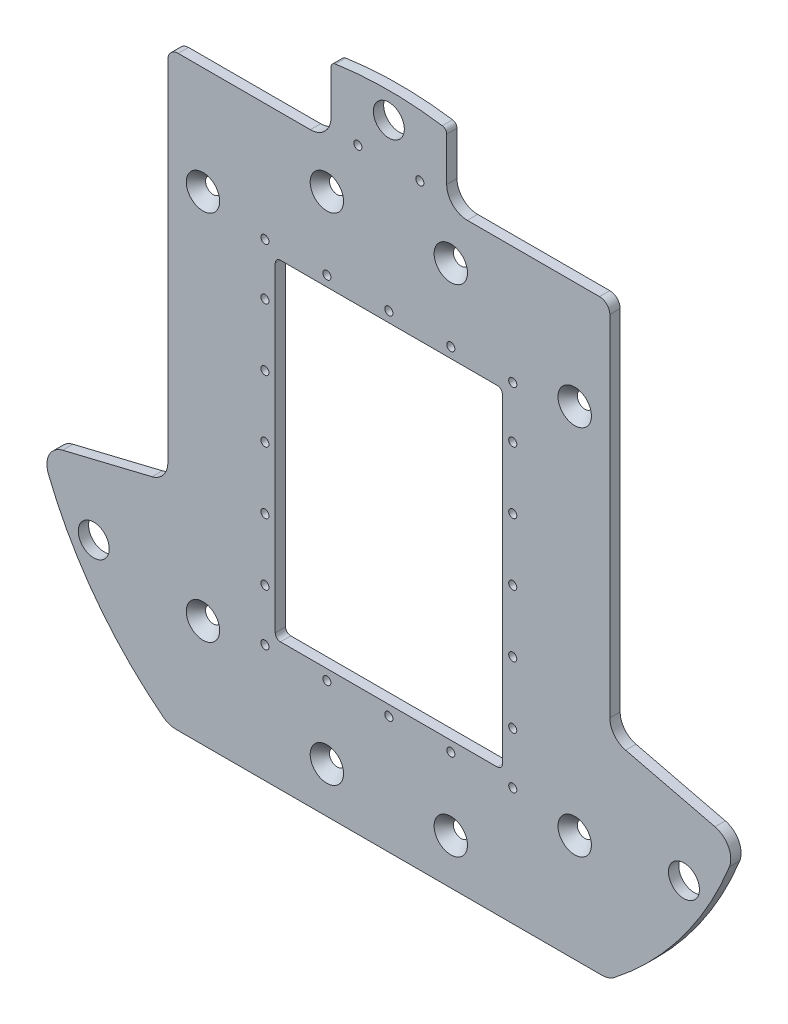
from build123d import *

# Parameters (mm, degrees)
SKETCH1_R                                      = 225.425
BOSS_EXTRUDE1_DEPTH                            = 3.175
F_3_4_0_75_DIAMETER_HOLE1_D                    = 19.05
CUT_EXTRUDE3_DEPTH                             = 319.814902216
CUT_EXTRUDE3_DEPTH_BACK                        = 319.814902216
SKETCH9_W                                      = 677.934066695
SKETCH9_H                                      = 88.131619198
SKETCH3_W                                      = 139.7
SKETCH3_H                                      = 203.2
CUT_EXTRUDE2_DEPTH                             = 312.117600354
CSK_FOR_5_16_FLAT_HEAD_MACHINE_SCREW1_AT_COUNT = 2
CSK_FOR_5_16_FLAT_HEAD_MACHINE_SCREW1_AT_PITCH = 76.2
CSK_FOR_5_16_FLAT_HEAD_MACHINE_SCREW_2_COUNT   = 2
CSK_FOR_5_16_FLAT_HEAD_MACHINE_SCREW_2_PITCH   = 85.194189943
CSK_FOR_5_16_FLAT_HEAD_MACHINE_SCREW_3_COUNT   = 2
CSK_FOR_5_16_FLAT_HEAD_MACHINE_SCREW_3_PITCH   = 157.090324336
CSK_FOR_5_16_FLAT_HEAD_MACHINE_SCREW_4_COUNT   = 2
CSK_FOR_5_16_FLAT_HEAD_MACHINE_SCREW_4_PITCH   = 304.8
CSK_FOR_5_16_FLAT_HEAD_MACHINE_SCREW_5_COUNT   = 2
CSK_FOR_5_16_FLAT_HEAD_MACHINE_SCREW_5_PITCH   = 314.180648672
CSK_FOR_5_16_FLAT_HEAD_MACHINE_SCREW_6_COUNT   = 2
CSK_FOR_5_16_FLAT_HEAD_MACHINE_SCREW_6_PITCH   = 277.372186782
CSK_FOR_5_16_FLAT_HEAD_MACHINE_SCREW_7_COUNT   = 2
CSK_FOR_5_16_FLAT_HEAD_MACHINE_SCREW_7_PITCH   = 307.17202021
F_10_CLEARANCE_HOLE1_D                         = 4.9784
FILLET4_R                                      = 3.175
FILLET5_R                                      = 12.7
CUT_EXTRUDE4_DEPTH                             = 309.286954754
CUT_EXTRUDE4_DEPTH_BACK                        = 309.286954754


with BuildPart() as part:
    # Sketch1 → Boss-Extrude1 (new, symmetric)
    with BuildSketch(Plane.XY):
        Circle(SKETCH1_R)
    extrude(amount=BOSS_EXTRUDE1_DEPTH, both=True)

    # 3_4 _0.75_ Diameter Hole1 (through all)
    with Locations(Plane.XY.offset(3.175)):
        with Locations((0, 209.55), (181.475623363, -104.775), (-181.475623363, -104.775)):
            Hole(F_3_4_0_75_DIAMETER_HOLE1_D / 2)

    # Sketch9 → Cut-Extrude3 (cut, two sides: drawn at the far end of the back side and taken through both)
    with BuildSketch(Plane.XY.offset(-CUT_EXTRUDE3_DEPTH_BACK)):
        Polygon((-135.89, 127), (-135.89, 180.34), (-35.56, 180.34), (-35.56, 224.405483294), (-133.35, 224.405483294), (-211.744366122, 177.8), (-211.744366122, 127), (-272.127976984, 127), (-272.127976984, -69.85), (-214.330138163, -69.85), (-135.89, -50.8), align=None)
        Polygon((135.89, 127), (135.89, 180.34), (35.56, 180.34), (35.56, 226.81791199), (137.790617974, 226.81791199), (191.015619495, 177.8), (191.015619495, 127), (269.785668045, 127), (269.785668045, -69.85), (214.330138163, -69.85), (135.89, -50.8), align=None)
        with Locations((-14.822007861, -224.405809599)):
            Rectangle(SKETCH9_W, SKETCH9_H)
    extrude(amount=CUT_EXTRUDE3_DEPTH + CUT_EXTRUDE3_DEPTH_BACK, mode=Mode.SUBTRACT)

    # Sketch3 → Cut-Extrude2 (cut, through all)
    with BuildSketch(Plane.XY.offset(3.175)):
        Rectangle(SKETCH3_W, SKETCH3_H)
    extrude(amount=-CUT_EXTRUDE2_DEPTH, mode=Mode.SUBTRACT)

    # Sketch12 → CSK for 5_16 Flat Head Machine Screw1 (revolve, cut)
    with BuildSketch(Plane(origin=(-38.1, 152.4, 3.175), x_dir=(0, -1, 0), z_dir=(1, 0, 0))):
        Polygon((0, 0), (0, 6.35), (4.1021, 6.35), (4.1021, 7.098214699), (10.2724839, 0), align=None)
    csk_for_5_16_flat_head_machine_screw1 = revolve(axis=Axis((-38.1, 152.4, 9.525), (0, 0, -1)), mode=Mode.SUBTRACT)

    # CSK for 5_16 Flat Head Machine Screw1 at: CSK for 5_16 Flat Head Machine Screw1 ×2
    with Locations(*[(i * CSK_FOR_5_16_FLAT_HEAD_MACHINE_SCREW1_AT_PITCH, 0, 0) for i in range(1, CSK_FOR_5_16_FLAT_HEAD_MACHINE_SCREW1_AT_COUNT)]):
        add(csk_for_5_16_flat_head_machine_screw1, mode=Mode.SUBTRACT)

    # CSK for 5_16 Flat Head Machine Screw 2: CSK for 5_16 Flat Head Machine Screw1 ×2
    with Locations(*[Vector(-0.894427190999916, -0.447213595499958, 0) * (i * CSK_FOR_5_16_FLAT_HEAD_MACHINE_SCREW_2_PITCH) for i in range(1, CSK_FOR_5_16_FLAT_HEAD_MACHINE_SCREW_2_COUNT)]):
        add(csk_for_5_16_flat_head_machine_screw1, mode=Mode.SUBTRACT)

    # CSK for 5_16 Flat Head Machine Screw 3: CSK for 5_16 Flat Head Machine Screw1 ×2
    with Locations(*[Vector(0.970142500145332, -0.24253562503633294, 0) * (i * CSK_FOR_5_16_FLAT_HEAD_MACHINE_SCREW_3_PITCH) for i in range(1, CSK_FOR_5_16_FLAT_HEAD_MACHINE_SCREW_3_COUNT)]):
        add(csk_for_5_16_flat_head_machine_screw1, mode=Mode.SUBTRACT)

    # CSK for 5_16 Flat Head Machine Screw 4: CSK for 5_16 Flat Head Machine Screw1 ×2
    with Locations(*[(0, -i * CSK_FOR_5_16_FLAT_HEAD_MACHINE_SCREW_4_PITCH, 0) for i in range(1, CSK_FOR_5_16_FLAT_HEAD_MACHINE_SCREW_4_COUNT)]):
        add(csk_for_5_16_flat_head_machine_screw1, mode=Mode.SUBTRACT)

    # CSK for 5_16 Flat Head Machine Screw 5: CSK for 5_16 Flat Head Machine Screw1 ×2
    with Locations(*[Vector(0.242535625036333, -0.970142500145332, 0) * (i * CSK_FOR_5_16_FLAT_HEAD_MACHINE_SCREW_5_PITCH) for i in range(1, CSK_FOR_5_16_FLAT_HEAD_MACHINE_SCREW_5_COUNT)]):
        add(csk_for_5_16_flat_head_machine_screw1, mode=Mode.SUBTRACT)

    # CSK for 5_16 Flat Head Machine Screw 6: CSK for 5_16 Flat Head Machine Screw1 ×2
    with Locations(*[Vector(-0.27472112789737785, -0.9615239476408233, 0) * (i * CSK_FOR_5_16_FLAT_HEAD_MACHINE_SCREW_6_PITCH) for i in range(1, CSK_FOR_5_16_FLAT_HEAD_MACHINE_SCREW_6_COUNT)]):
        add(csk_for_5_16_flat_head_machine_screw1, mode=Mode.SUBTRACT)

    # CSK for 5_16 Flat Head Machine Screw 7: CSK for 5_16 Flat Head Machine Screw1 ×2
    with Locations(*[Vector(0.496138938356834, -0.8682431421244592, 0) * (i * CSK_FOR_5_16_FLAT_HEAD_MACHINE_SCREW_7_PITCH) for i in range(1, CSK_FOR_5_16_FLAT_HEAD_MACHINE_SCREW_7_COUNT)]):
        add(csk_for_5_16_flat_head_machine_screw1, mode=Mode.SUBTRACT)

    # 10 Clearance Hole1 (through all)
    with Locations(Plane.XY.offset(3.175)):
        with Locations((-76.2, 76.2), (-76.2, 38.1), (-76.2, 107.95), (-38.1, 107.95), (0, 107.95), (38.1, 107.95), (76.2, 107.95), (76.2, 76.2), (76.2, 38.1), (76.2, 0), (76.2, -38.1), (76.2, -76.2), (76.2, -107.95), (38.1, -107.95), (0, -107.95), (-38.1, -107.95), (-76.2, -107.95), (-76.2, -76.2), (-76.2, -38.1), (-76.2, 0), (19.05, 186.69), (-19.05, 186.69)):
            Hole(F_10_CLEARANCE_HOLE1_D / 2)

    # Fillet4
    fillet4_edges = [part.edges().sort_by_distance(p)[0] for p in [
        (69.85, 101.6, 0),
        (69.85, -101.6, 0),
        (-69.85, -101.6, 0),
        (-69.85, 101.6, 0),
        (35.56, 222.602598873, 0),
        (-35.56, 222.602598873, 0),
    ]]
    fillet(fillet4_edges, radius=FILLET4_R)

    # Fillet5
    fillet5_edges = [part.edges().sort_by_distance(p)[0] for p in [
        (-135.255, -180.34, 0),
        (135.255, -180.34, 0),
        (35.56, 180.34, 0),
        (135.89, -50.8, 0),
        (214.330138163, -69.85, 0),
        (-135.89, -50.8, 0),
        (-35.56, 180.34, 0),
        (-214.330138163, -69.85, 0),
    ]]
    fillet(fillet5_edges, radius=FILLET5_R)

    # Sketch13 → Cut-Extrude4 (cut, two sides: drawn at the far end of the back side and taken through both)
    with BuildSketch(Plane.XY.offset(-CUT_EXTRUDE4_DEPTH_BACK)):
        with BuildLine():
            Line((129.54, 180.34), (135.89, 180.34))
            Line((135.89, 180.34), (135.89, 173.99))
            ThreePointArc((135.89, 173.99), (134.030128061, 178.480128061), (129.54, 180.34))
        make_face()
        with BuildLine():
            Line((-135.89, 173.99), (-135.89, 180.34))
            Line((-135.89, 180.34), (-129.54, 180.34))
            ThreePointArc((-129.54, 180.34), (-134.030128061, 178.480128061), (-135.89, 173.99))
        make_face()
    extrude(amount=CUT_EXTRUDE4_DEPTH + CUT_EXTRUDE4_DEPTH_BACK, mode=Mode.SUBTRACT)


solid = part.part
